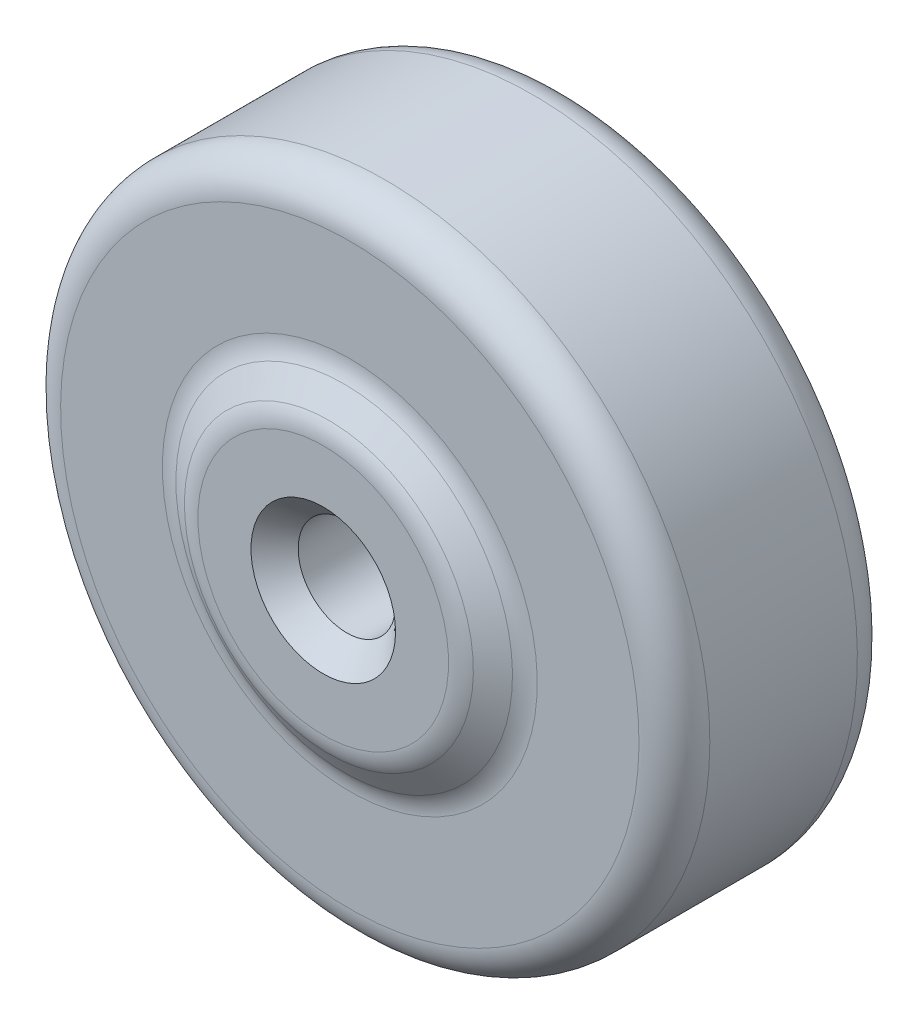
ISO-10303-21;
HEADER;
FILE_DESCRIPTION(('STEP AP214'),'2;1');
FILE_NAME('part.step','',(''),(''),'','','');
FILE_SCHEMA(('AUTOMOTIVE_DESIGN { 1 0 10303 214 1 1 1 1 }'));
ENDSEC;
DATA;
#1=APPLICATION_CONTEXT('core data for automotive mechanical design processes');
#2=APPLICATION_PROTOCOL_DEFINITION('international standard','automotive_design',2000,#1);
#3=PRODUCT_CONTEXT('',#1,'mechanical');
#4=PRODUCT('Part','Part','',(#3));
#5=PRODUCT_RELATED_PRODUCT_CATEGORY('part','',(#4));
#6=PRODUCT_DEFINITION_FORMATION('','',#4);
#7=PRODUCT_DEFINITION_CONTEXT('part definition',#1,'design');
#8=PRODUCT_DEFINITION('design','',#6,#7);
#9=PRODUCT_DEFINITION_SHAPE('','',#8);
#10=(LENGTH_UNIT() NAMED_UNIT(*) SI_UNIT(.MILLI.,.METRE.));
#11=(NAMED_UNIT(*) PLANE_ANGLE_UNIT() SI_UNIT($,.RADIAN.));
#12=(NAMED_UNIT(*) SI_UNIT($,.STERADIAN.) SOLID_ANGLE_UNIT());
#13=UNCERTAINTY_MEASURE_WITH_UNIT(LENGTH_MEASURE(1.E-05),#10,'distance_accuracy_value','');
#14=(GEOMETRIC_REPRESENTATION_CONTEXT(3) GLOBAL_UNCERTAINTY_ASSIGNED_CONTEXT((#13)) GLOBAL_UNIT_ASSIGNED_CONTEXT((#10,
#11,#12)) REPRESENTATION_CONTEXT('',''));
#15=CARTESIAN_POINT('',(0.,0.,0.));
#16=DIRECTION('',(0.,0.,1.));
#17=DIRECTION('',(1.,0.,0.));
#18=AXIS2_PLACEMENT_3D('',#15,#16,#17);
#19=CARTESIAN_POINT('',(4.125,0.,11.5));
#20=DIRECTION('',(0.,0.,1.));
#21=DIRECTION('',(1.,0.,0.));
#22=AXIS2_PLACEMENT_3D('',#19,#20,#21);
#23=PLANE('',#22);
#24=CARTESIAN_POINT('',(0.,0.,11.4999999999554));
#25=DIRECTION('',(0.,0.,1.));
#26=DIRECTION('',(1.,0.,0.));
#27=AXIS2_PLACEMENT_3D('',#24,#25,#26);
#28=CIRCLE('',#27,6.12500000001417);
#29=CARTESIAN_POINT('',(6.12500000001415,0.,11.4999999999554));
#30=VERTEX_POINT('',#29);
#31=EDGE_CURVE('E75',#30,#30,#28,.F.);
#32=ORIENTED_EDGE('',*,*,#31,.T.);
#33=EDGE_LOOP('',(#32));
#34=FACE_BOUND('',#33,.T.);
#35=CARTESIAN_POINT('',(0.,0.,11.5));
#36=DIRECTION('',(0.,0.,-1.));
#37=DIRECTION('',(0.877582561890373,0.479425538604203,0.));
#38=AXIS2_PLACEMENT_3D('',#35,#36,#37);
#39=CIRCLE('',#38,10.6188943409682);
#40=CARTESIAN_POINT('',(9.31895650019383,5.09096913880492,11.5));
#41=VERTEX_POINT('',#40);
#42=CARTESIAN_POINT('',(-9.31895657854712,-5.09096899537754,11.5));
#43=VERTEX_POINT('',#42);
#44=EDGE_CURVE('E65',#41,#43,#39,.T.);
#45=ORIENTED_EDGE('',*,*,#44,.F.);
#46=CARTESIAN_POINT('',(0.,0.,11.5));
#47=DIRECTION('',(0.,0.,-1.));
#48=DIRECTION('',(-0.877582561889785,-0.479425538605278,0.));
#49=AXIS2_PLACEMENT_3D('',#46,#47,#48);
#50=CIRCLE('',#49,10.6188943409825);
#51=EDGE_CURVE('E69',#43,#41,#50,.T.);
#52=ORIENTED_EDGE('',*,*,#51,.F.);
#53=EDGE_LOOP('',(#45,#52));
#54=FACE_BOUND('',#53,.T.);
#55=ADVANCED_FACE('F16',(#34,#54),#23,.T.);
#56=CARTESIAN_POINT('',(0.,0.,8.5));
#57=DIRECTION('',(0.,0.,1.));
#58=DIRECTION('',(0.877582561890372,0.479425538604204,0.));
#59=AXIS2_PLACEMENT_3D('',#56,#57,#58);
#60=TOROIDAL_SURFACE('',#59,10.618894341,3.);
#61=CARTESIAN_POINT('',(0.,0.,11.0235354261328));
#62=DIRECTION('',(0.,0.,-1.));
#63=DIRECTION('',(0.877582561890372,0.479425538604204,0.));
#64=AXIS2_PLACEMENT_3D('',#61,#62,#63);
#65=CIRCLE('',#64,12.2411671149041);
#66=CARTESIAN_POINT('',(10.7426347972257,5.86872813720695,11.0235354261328));
#67=VERTEX_POINT('',#66);
#68=EDGE_CURVE('E102',#67,#67,#65,.T.);
#69=ORIENTED_EDGE('',*,*,#68,.F.);
#70=EDGE_LOOP('',(#69));
#71=FACE_BOUND('',#70,.T.);
#72=ORIENTED_EDGE('',*,*,#51,.T.);
#73=ORIENTED_EDGE('',*,*,#44,.T.);
#74=EDGE_LOOP('',(#72,#73));
#75=FACE_BOUND('',#74,.T.);
#76=ADVANCED_FACE('F74',(#71,#75),#60,.T.);
#77=CARTESIAN_POINT('',(0.,0.,11.4999999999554));
#78=DIRECTION('',(0.,0.,1.));
#79=DIRECTION('',(1.,0.,0.));
#80=AXIS2_PLACEMENT_3D('',#77,#78,#79);
#81=CONICAL_SURFACE('',#80,6.12500000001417,0.785398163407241);
#82=ORIENTED_EDGE('',*,*,#31,.F.);
#83=EDGE_LOOP('',(#82));
#84=FACE_BOUND('',#83,.T.);
#85=CARTESIAN_POINT('',(0.,0.,9.5));
#86=DIRECTION('',(0.,0.,1.));
#87=DIRECTION('',(1.,0.,0.));
#88=AXIS2_PLACEMENT_3D('',#85,#86,#87);
#89=CIRCLE('',#88,4.125);
#90=CARTESIAN_POINT('',(4.125,0.,9.5));
#91=VERTEX_POINT('',#90);
#92=EDGE_CURVE('E100',#91,#91,#89,.F.);
#93=ORIENTED_EDGE('',*,*,#92,.T.);
#94=EDGE_LOOP('',(#93));
#95=FACE_BOUND('',#94,.T.);
#96=ADVANCED_FACE('F94',(#84,#95),#81,.F.);
#97=CARTESIAN_POINT('',(0.,0.,9.72646457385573));
#98=DIRECTION('',(0.,0.,-1.));
#99=DIRECTION('',(-1.,0.,0.));
#100=AXIS2_PLACEMENT_3D('',#97,#98,#99);
#101=CONICAL_SURFACE('',#100,14.2588328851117,0.999458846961);
#102=CARTESIAN_POINT('',(0.,0.,9.72646457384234));
#103=DIRECTION('',(0.,0.,1.));
#104=DIRECTION('',(0.877582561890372,0.479425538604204,0.));
#105=AXIS2_PLACEMENT_3D('',#102,#103,#104);
#106=CIRCLE('',#105,14.2588328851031);
#107=CARTESIAN_POINT('',(12.5133030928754,6.83604863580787,9.72646457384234));
#108=VERTEX_POINT('',#107);
#109=EDGE_CURVE('E107',#108,#108,#106,.T.);
#110=ORIENTED_EDGE('',*,*,#109,.T.);
#111=EDGE_LOOP('',(#110));
#112=FACE_BOUND('',#111,.T.);
#113=ORIENTED_EDGE('',*,*,#68,.T.);
#114=EDGE_LOOP('',(#113));
#115=FACE_BOUND('',#114,.T.);
#116=ADVANCED_FACE('F296',(#112,#115),#101,.T.);
#117=CARTESIAN_POINT('',(0.,0.,12.25));
#118=DIRECTION('',(0.,0.,1.));
#119=DIRECTION('',(0.877582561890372,0.479425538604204,0.));
#120=AXIS2_PLACEMENT_3D('',#117,#118,#119);
#121=TOROIDAL_SURFACE('',#120,15.881105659,3.);
#122=CARTESIAN_POINT('',(0.,0.,9.25));
#123=DIRECTION('',(0.,0.,1.));
#124=DIRECTION('',(0.877582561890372,0.479425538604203,0.));
#125=AXIS2_PLACEMENT_3D('',#122,#123,#124);
#126=CIRCLE('',#125,15.8811056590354);
#127=CARTESIAN_POINT('',(-13.9369813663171,-7.61380767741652,9.25));
#128=VERTEX_POINT('',#127);
#129=CARTESIAN_POINT('',(13.9369813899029,7.61380763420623,9.25));
#130=VERTEX_POINT('',#129);
#131=EDGE_CURVE('E269',#128,#130,#126,.F.);
#132=ORIENTED_EDGE('',*,*,#131,.F.);
#133=CARTESIAN_POINT('',(-13.9369813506,-7.61380770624,9.25));
#134=CARTESIAN_POINT('',(-13.8124054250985,-7.84185390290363,9.25));
#135=CARTESIAN_POINT('',(-13.6822231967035,-8.066836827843,9.25));
#136=CARTESIAN_POINT('',(-13.4109804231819,-8.51014677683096,9.25));
#137=CARTESIAN_POINT('',(-13.2699198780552,-8.72847380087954,9.25));
#138=CARTESIAN_POINT('',(-12.9772547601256,-9.15794259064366,9.25));
#139=CARTESIAN_POINT('',(-12.8256501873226,-9.3690843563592,9.25));
#140=CARTESIAN_POINT('',(-12.5122637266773,-9.78367487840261,9.25));
#141=CARTESIAN_POINT('',(-12.3504818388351,-9.9871236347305,9.25));
#142=CARTESIAN_POINT('',(-12.0171300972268,-10.3858377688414,9.25));
#143=CARTESIAN_POINT('',(-11.8455602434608,-10.5811031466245,9.25));
#144=CARTESIAN_POINT('',(-11.4930460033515,-10.962980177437,9.25));
#145=CARTESIAN_POINT('',(-11.3121016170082,-11.1495918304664,9.25));
#146=CARTESIAN_POINT('',(-10.9412741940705,-11.5137118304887,9.25));
#147=CARTESIAN_POINT('',(-10.751391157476,-11.6912201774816,9.25));
#148=CARTESIAN_POINT('',(-10.3631438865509,-12.0367059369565,9.25));
#149=CARTESIAN_POINT('',(-10.1647796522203,-12.2046833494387,9.25));
#150=CARTESIAN_POINT('',(-9.76004786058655,-12.5307025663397,9.25));
#151=CARTESIAN_POINT('',(-9.55368030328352,-12.6887443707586,9.25));
#152=CARTESIAN_POINT('',(-9.13343902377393,-12.9945116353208,9.25));
#153=CARTESIAN_POINT('',(-8.91956530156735,-13.1422370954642,9.25));
#154=CARTESIAN_POINT('',(-8.4848269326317,-13.4270157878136,9.25));
#155=CARTESIAN_POINT('',(-8.26396228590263,-13.5640690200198,9.25));
#156=CARTESIAN_POINT('',(-7.81577415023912,-13.8271730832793,9.25));
#157=CARTESIAN_POINT('',(-7.58845066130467,-13.9532239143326,9.25));
#158=CARTESIAN_POINT('',(-7.12789248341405,-14.1940195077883,9.25));
#159=CARTESIAN_POINT('',(-6.89465779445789,-14.3087642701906,9.25));
#160=CARTESIAN_POINT('',(-6.42283909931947,-14.5266712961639,9.25));
#161=CARTESIAN_POINT('',(-6.18425509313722,-14.6298335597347,9.25));
#162=CARTESIAN_POINT('',(-5.70231253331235,-14.8243270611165,9.25));
#163=CARTESIAN_POINT('',(-5.45895397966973,-14.9156582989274,9.25));
#164=CARTESIAN_POINT('',(-4.96804859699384,-15.0862697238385,9.25));
#165=CARTESIAN_POINT('',(-4.72050176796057,-15.1655499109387,9.25));
#166=CARTESIAN_POINT('',(-4.22181619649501,-15.3118682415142,9.25));
#167=CARTESIAN_POINT('',(-3.97067745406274,-15.3789063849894,9.25));
#168=CARTESIAN_POINT('',(-3.4654130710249,-15.500579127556,9.25));
#169=CARTESIAN_POINT('',(-3.21128743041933,-15.5552137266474,9.25));
#170=CARTESIAN_POINT('',(-2.70066146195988,-15.651947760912,9.25));
#171=CARTESIAN_POINT('',(-2.44416113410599,-15.6940471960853,9.25));
#172=CARTESIAN_POINT('',(-1.92940372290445,-15.7656094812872,9.25));
#173=CARTESIAN_POINT('',(-1.67114663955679,-15.795072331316,9.25));
#174=CARTESIAN_POINT('',(-1.15349788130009,-15.8412904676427,9.25));
#175=CARTESIAN_POINT('',(-0.894106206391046,-15.8580457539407,9.25));
#176=CARTESIAN_POINT('',(-0.374813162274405,-15.8788083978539,9.25));
#177=CARTESIAN_POINT('',(-0.114911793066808,-15.882815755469,9.25));
#178=CARTESIAN_POINT('',(0.404774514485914,-15.8780728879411,9.25));
#179=CARTESIAN_POINT('',(0.664559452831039,-15.8693226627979,9.25));
#180=CARTESIAN_POINT('',(1.18338705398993,-15.8390857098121,9.25));
#181=CARTESIAN_POINT('',(1.44242971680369,-15.8175989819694,9.25));
#182=CARTESIAN_POINT('',(1.95914871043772,-15.7619407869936,9.25));
#183=CARTESIAN_POINT('',(2.21682504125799,-15.7277693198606,9.25));
#184=CARTESIAN_POINT('',(2.73019060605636,-15.6468239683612,9.25));
#185=CARTESIAN_POINT('',(2.98587984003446,-15.6000500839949,9.25));
#186=CARTESIAN_POINT('',(3.49465523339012,-15.4940125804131,9.25));
#187=CARTESIAN_POINT('',(3.74774139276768,-15.4347489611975,9.25));
#188=CARTESIAN_POINT('',(4.25070093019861,-15.3038747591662,9.25));
#189=CARTESIAN_POINT('',(4.50057430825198,-15.2322641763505,9.25));
#190=CARTESIAN_POINT('',(4.99650631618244,-15.0768685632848,9.25));
#191=CARTESIAN_POINT('',(5.24256494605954,-14.9930835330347,9.25));
#192=CARTESIAN_POINT('',(5.73027468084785,-14.8135408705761,9.25));
#193=CARTESIAN_POINT('',(5.97192578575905,-14.7177832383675,9.25));
#194=CARTESIAN_POINT('',(6.45023831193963,-14.5145260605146,9.25));
#195=CARTESIAN_POINT('',(6.68689973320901,-14.4070265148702,9.25));
#196=CARTESIAN_POINT('',(7.15466275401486,-14.1805444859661,9.25));
#197=CARTESIAN_POINT('',(7.38576435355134,-14.0615620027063,9.25));
#198=CARTESIAN_POINT('',(7.84185098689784,-13.8124007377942,9.25));
#199=CARTESIAN_POINT('',(8.06683602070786,-13.6822219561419,9.25));
#200=CARTESIAN_POINT('',(8.51014751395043,-13.410981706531,9.25));
#201=CARTESIAN_POINT('',(8.72847397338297,-13.2699202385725,9.25));
#202=CARTESIAN_POINT('',(9.15794235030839,-12.9772544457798,9.25));
#203=CARTESIAN_POINT('',(9.36908426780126,-12.8256501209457,9.25));
#204=CARTESIAN_POINT('',(9.78367490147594,-12.5122638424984,9.25));
#205=CARTESIAN_POINT('',(9.98712361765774,-12.3504818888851,9.25));
#206=CARTESIAN_POINT('',(10.3858377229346,-12.0171300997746,9.25));
#207=CARTESIAN_POINT('',(10.5811031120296,-11.8455602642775,9.25));
#208=CARTESIAN_POINT('',(10.962980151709,-11.4930460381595,9.25));
#209=CARTESIAN_POINT('',(11.1495918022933,-11.3121016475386,9.25));
#210=CARTESIAN_POINT('',(11.513711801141,-10.9412742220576,9.25));
#211=CARTESIAN_POINT('',(11.6912201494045,-10.7513911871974,9.25));
#212=CARTESIAN_POINT('',(12.0367059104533,-10.3631439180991,9.25));
#213=CARTESIAN_POINT('',(12.2046833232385,-10.1647796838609,9.25));
#214=CARTESIAN_POINT('',(12.5307025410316,-9.76004789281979,9.25));
#215=CARTESIAN_POINT('',(12.6887443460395,-9.55368033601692,9.25));
#216=CARTESIAN_POINT('',(12.994511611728,-9.13343905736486,9.25));
#217=CARTESIAN_POINT('',(13.1422370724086,-8.91956533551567,9.25));
#218=CARTESIAN_POINT('',(13.4270157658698,-8.48482696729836,9.25));
#219=CARTESIAN_POINT('',(13.5640689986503,-8.26396232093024,9.25));
#220=CARTESIAN_POINT('',(13.8271730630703,-7.81577418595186,9.25));
#221=CARTESIAN_POINT('',(13.9532238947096,-7.58845069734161,9.25));
#222=CARTESIAN_POINT('',(14.194019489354,-7.12789252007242,9.25));
#223=CARTESIAN_POINT('',(14.308764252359,-6.89465783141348,9.25));
#224=CARTESIAN_POINT('',(14.526671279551,-6.42283913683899,9.25));
#225=CARTESIAN_POINT('',(14.6298335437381,-6.18425513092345,9.25));
#226=CARTESIAN_POINT('',(14.8243270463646,-5.70231257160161,9.25));
#227=CARTESIAN_POINT('',(14.9156582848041,-5.45895401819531,9.25));
#228=CARTESIAN_POINT('',(15.0862697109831,-4.96804863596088,9.25));
#229=CARTESIAN_POINT('',(15.1655498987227,-4.72050180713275,9.25));
#230=CARTESIAN_POINT('',(15.3118682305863,-4.2218162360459,9.25));
#231=CARTESIAN_POINT('',(15.3789063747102,-3.97067749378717,9.25));
#232=CARTESIAN_POINT('',(15.500579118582,-3.46541311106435,9.25));
#233=CARTESIAN_POINT('',(15.5552137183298,-3.21128747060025,9.25));
#234=CARTESIAN_POINT('',(15.6519477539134,-2.70066150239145,9.25));
#235=CARTESIAN_POINT('',(15.6940471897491,-2.44416117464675,9.25));
#236=CARTESIAN_POINT('',(15.7656094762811,-1.92940376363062,9.25));
#237=CARTESIAN_POINT('',(15.7950723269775,-1.67114668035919,9.25));
#238=CARTESIAN_POINT('',(15.8412904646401,-1.15349792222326,9.25));
#239=CARTESIAN_POINT('',(15.8580457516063,-0.894106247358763,9.25));
#240=CARTESIAN_POINT('',(15.8788083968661,-0.374813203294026,9.25));
#241=CARTESIAN_POINT('',(15.8828157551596,-0.114911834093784,9.25));
#242=CARTESIAN_POINT('',(15.8780728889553,0.404774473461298,9.25));
#243=CARTESIAN_POINT('',(15.8693226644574,0.664559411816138,9.25));
#244=CARTESIAN_POINT('',(15.8390857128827,1.18338701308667,9.25));
#245=CARTESIAN_POINT('',(15.8175989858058,1.44242967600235,9.25));
#246=CARTESIAN_POINT('',(15.7619407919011,1.95914866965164,9.25));
#247=CARTESIAN_POINT('',(15.7277693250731,2.21682500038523,9.25));
#248=CARTESIAN_POINT('',(15.6468239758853,2.730190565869,9.25));
#249=CARTESIAN_POINT('',(15.6000500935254,2.98587980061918,9.25));
#250=CARTESIAN_POINT('',(15.4940125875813,3.4946551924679,9.25));
#251=CARTESIAN_POINT('',(15.4347489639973,3.74774134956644,9.25));
#252=CARTESIAN_POINT('',(15.3038747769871,4.25070089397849,9.25));
#253=CARTESIAN_POINT('',(15.232264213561,4.500574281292,9.25));
#254=CARTESIAN_POINT('',(15.0768685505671,4.99650626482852,9.25));
#255=CARTESIAN_POINT('',(14.9930834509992,5.24256486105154,9.25));
#256=CARTESIAN_POINT('',(14.8135409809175,5.7302746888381,9.25));
#257=CARTESIAN_POINT('',(14.7177836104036,5.97192592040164,9.25));
#258=CARTESIAN_POINT('',(14.5145257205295,6.45023810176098,9.25));
#259=CARTESIAN_POINT('',(14.4070252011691,6.68689905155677,9.25));
#260=CARTESIAN_POINT('',(14.1805458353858,7.15466336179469,9.25));
#261=CARTESIAN_POINT('',(14.0615669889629,7.38576672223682,9.25));
#262=CARTESIAN_POINT('',(13.9369813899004,7.61380763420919,9.25));
#263=B_SPLINE_CURVE_WITH_KNOTS('',3,(#133,#134,#135,#136,#137,#138,#139,#140,#141,#142,#143,
#144,#145,#146,#147,#148,#149,#150,#151,#152,#153,#154,#155,#156,#157,#158,#159,#160,#161,#162,
#163,#164,#165,#166,#167,#168,#169,#170,#171,#172,#173,#174,#175,#176,#177,#178,#179,#180,#181,
#182,#183,#184,#185,#186,#187,#188,#189,#190,#191,#192,#193,#194,#195,#196,#197,#198,#199,#200,
#201,#202,#203,#204,#205,#206,#207,#208,#209,#210,#211,#212,#213,#214,#215,#216,#217,#218,#219,
#220,#221,#222,#223,#224,#225,#226,#227,#228,#229,#230,#231,#232,#233,#234,#235,#236,#237,#238,
#239,#240,#241,#242,#243,#244,#245,#246,#247,#248,#249,#250,#251,#252,#253,#254,#255,#256,#257,
#258,#259,#260,#261,#262),.UNSPECIFIED.,.F.,.F.,(4,2,2,2,2,2,2,2,2,2,2,2,2,2,2,2,2,2,2,2,2,2,2,
2,2,2,2,2,2,2,2,2,2,2,2,2,2,2,2,2,2,2,2,2,2,2,2,2,2,2,2,2,2,2,2,2,2,2,2,2,2,2,2,2,4),(0.,
0.779483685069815,1.5589673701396,2.33845105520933,3.11793474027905,3.89741842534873,
4.67690211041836,5.45638579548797,6.23586948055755,7.0153531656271,7.79483685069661,
8.57432053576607,9.35380422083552,10.1332879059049,10.9127715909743,11.6922552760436,
12.4717389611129,13.2512226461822,14.0307063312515,14.8101900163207,15.5896737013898,
16.369157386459,17.1486410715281,17.9281247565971,18.7076084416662,19.4870921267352,
20.2665758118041,21.0460594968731,21.825543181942,22.6050268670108,23.3845105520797,
24.1639942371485,24.9434779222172,25.722961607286,26.5024452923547,27.2819289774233,
28.061412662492,28.8408963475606,29.6203800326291,30.3998637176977,31.1793474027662,
31.9588310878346,32.738314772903,33.5177984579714,34.2972821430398,35.0767658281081,
35.8562495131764,36.6357331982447,37.4152168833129,38.1947005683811,38.9741842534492,
39.7536679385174,40.5331516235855,41.3126353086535,42.0921189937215,42.8716026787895,
43.6510863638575,44.4305700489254,45.2100537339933,45.9895374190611,46.769021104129,
47.5485047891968,48.3279884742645,49.1074721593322,49.8869558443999),.UNSPECIFIED.);
#264=EDGE_CURVE('E314',#130,#128,#263,.F.);
#265=ORIENTED_EDGE('',*,*,#264,.F.);
#266=EDGE_LOOP('',(#132,#265));
#267=FACE_BOUND('',#266,.T.);
#268=ORIENTED_EDGE('',*,*,#109,.F.);
#269=EDGE_LOOP('',(#268));
#270=FACE_BOUND('',#269,.T.);
#271=ADVANCED_FACE('F293',(#267,#270),#121,.F.);
#272=CARTESIAN_POINT('',(0.,0.,0.));
#273=DIRECTION('',(0.,0.,1.));
#274=DIRECTION('',(1.,0.,0.));
#275=AXIS2_PLACEMENT_3D('',#272,#273,#274);
#276=CYLINDRICAL_SURFACE('',#275,4.125);
#277=ORIENTED_EDGE('',*,*,#92,.F.);
#278=EDGE_LOOP('',(#277));
#279=FACE_BOUND('',#278,.T.);
#280=CARTESIAN_POINT('',(0.,0.,-9.49999999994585));
#281=DIRECTION('',(0.,0.,-1.));
#282=DIRECTION('',(0.877582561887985,0.479425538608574,0.));
#283=AXIS2_PLACEMENT_3D('',#280,#281,#282);
#284=CIRCLE('',#283,4.12499999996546);
#285=CARTESIAN_POINT('',(3.62002806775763,1.97763034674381,-9.49999999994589));
#286=VERTEX_POINT('',#285);
#287=EDGE_CURVE('E282',#286,#286,#284,.T.);
#288=ORIENTED_EDGE('',*,*,#287,.T.);
#289=EDGE_LOOP('',(#288));
#290=FACE_BOUND('',#289,.T.);
#291=ADVANCED_FACE('F249',(#279,#290),#276,.F.);
#292=CARTESIAN_POINT('',(15.,0.,9.25));
#293=DIRECTION('',(0.,0.,1.));
#294=DIRECTION('',(1.,0.,0.));
#295=AXIS2_PLACEMENT_3D('',#292,#293,#294);
#296=PLANE('',#295);
#297=ORIENTED_EDGE('',*,*,#264,.T.);
#298=ORIENTED_EDGE('',*,*,#131,.T.);
#299=EDGE_LOOP('',(#297,#298));
#300=FACE_BOUND('',#299,.T.);
#301=CARTESIAN_POINT('',(0.,0.,9.25));
#302=DIRECTION('',(0.,0.,-1.));
#303=DIRECTION('',(0.877582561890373,0.479425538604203,0.));
#304=AXIS2_PLACEMENT_3D('',#301,#302,#303);
#305=CIRCLE('',#304,24.4999999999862);
#306=CARTESIAN_POINT('',(21.5007727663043,11.7459256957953,9.25));
#307=VERTEX_POINT('',#306);
#308=CARTESIAN_POINT('',(-21.5007727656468,-11.7459256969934,9.25));
#309=VERTEX_POINT('',#308);
#310=EDGE_CURVE('E207',#307,#309,#305,.T.);
#311=ORIENTED_EDGE('',*,*,#310,.F.);
#312=CARTESIAN_POINT('',(0.,0.,9.25));
#313=DIRECTION('',(0.,0.,-1.));
#314=DIRECTION('',(-0.877582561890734,-0.479425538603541,0.));
#315=AXIS2_PLACEMENT_3D('',#312,#313,#314);
#316=CIRCLE('',#315,24.4999999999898);
#317=EDGE_CURVE('E278',#309,#307,#316,.T.);
#318=ORIENTED_EDGE('',*,*,#317,.F.);
#319=EDGE_LOOP('',(#311,#318));
#320=FACE_BOUND('',#319,.T.);
#321=ADVANCED_FACE('F240',(#300,#320),#296,.T.);
#322=CARTESIAN_POINT('',(0.,0.,-11.4999999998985));
#323=DIRECTION('',(0.,0.,-1.));
#324=DIRECTION('',(-1.,0.,0.));
#325=AXIS2_PLACEMENT_3D('',#322,#323,#324);
#326=CONICAL_SURFACE('',#325,6.12499999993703,0.785398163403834);
#327=ORIENTED_EDGE('',*,*,#287,.F.);
#328=EDGE_LOOP('',(#327));
#329=FACE_BOUND('',#328,.T.);
#330=CARTESIAN_POINT('',(0.,0.,-11.4999999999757));
#331=DIRECTION('',(0.,0.,-1.));
#332=DIRECTION('',(-1.,0.,0.));
#333=AXIS2_PLACEMENT_3D('',#330,#331,#332);
#334=CIRCLE('',#333,6.12500000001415);
#335=CARTESIAN_POINT('',(-6.12500000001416,0.,-11.4999999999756));
#336=VERTEX_POINT('',#335);
#337=EDGE_CURVE('E83',#336,#336,#334,.T.);
#338=ORIENTED_EDGE('',*,*,#337,.T.);
#339=EDGE_LOOP('',(#338));
#340=FACE_BOUND('',#339,.T.);
#341=ADVANCED_FACE('F223',(#329,#340),#326,.F.);
#342=CARTESIAN_POINT('',(0.,0.,6.25));
#343=DIRECTION('',(0.,0.,1.));
#344=DIRECTION('',(0.877582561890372,0.479425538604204,0.));
#345=AXIS2_PLACEMENT_3D('',#342,#343,#344);
#346=TOROIDAL_SURFACE('',#345,24.5,3.);
#347=CARTESIAN_POINT('',(0.,0.,6.25));
#348=DIRECTION('',(0.,0.,1.));
#349=DIRECTION('',(1.,0.,0.));
#350=AXIS2_PLACEMENT_3D('',#347,#348,#349);
#351=CIRCLE('',#350,27.5);
#352=CARTESIAN_POINT('',(27.5,0.,6.25));
#353=VERTEX_POINT('',#352);
#354=EDGE_CURVE('E230',#353,#353,#351,.F.);
#355=ORIENTED_EDGE('',*,*,#354,.F.);
#356=EDGE_LOOP('',(#355));
#357=FACE_BOUND('',#356,.T.);
#358=ORIENTED_EDGE('',*,*,#317,.T.);
#359=ORIENTED_EDGE('',*,*,#310,.T.);
#360=EDGE_LOOP('',(#358,#359));
#361=FACE_BOUND('',#360,.T.);
#362=ADVANCED_FACE('F214',(#357,#361),#346,.T.);
#363=CARTESIAN_POINT('',(4.125,0.,-11.5));
#364=DIRECTION('',(0.,0.,1.));
#365=DIRECTION('',(1.,0.,0.));
#366=AXIS2_PLACEMENT_3D('',#363,#364,#365);
#367=PLANE('',#366);
#368=ORIENTED_EDGE('',*,*,#337,.F.);
#369=EDGE_LOOP('',(#368));
#370=FACE_BOUND('',#369,.T.);
#371=CARTESIAN_POINT('',(0.,0.,-11.5));
#372=DIRECTION('',(0.,0.,1.));
#373=DIRECTION('',(-0.877582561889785,-0.479425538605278,0.));
#374=AXIS2_PLACEMENT_3D('',#371,#372,#373);
#375=CIRCLE('',#374,10.6188943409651);
#376=CARTESIAN_POINT('',(-9.31895657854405,-5.09096899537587,-11.5));
#377=VERTEX_POINT('',#376);
#378=CARTESIAN_POINT('',(9.31895650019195,5.09096913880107,-11.5));
#379=VERTEX_POINT('',#378);
#380=EDGE_CURVE('E374',#377,#379,#375,.T.);
#381=ORIENTED_EDGE('',*,*,#380,.F.);
#382=CARTESIAN_POINT('',(0.,0.,-11.5));
#383=DIRECTION('',(0.,0.,1.));
#384=DIRECTION('',(0.877582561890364,0.479425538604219,0.));
#385=AXIS2_PLACEMENT_3D('',#382,#383,#384);
#386=CIRCLE('',#385,10.6188943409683);
#387=EDGE_CURVE('E233',#379,#377,#386,.T.);
#388=ORIENTED_EDGE('',*,*,#387,.F.);
#389=EDGE_LOOP('',(#381,#388));
#390=FACE_BOUND('',#389,.T.);
#391=ADVANCED_FACE('F184',(#370,#390),#367,.F.);
#392=CARTESIAN_POINT('',(0.,0.,-8.5));
#393=DIRECTION('',(0.,0.,1.));
#394=DIRECTION('',(-0.975671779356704,-0.219236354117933,0.));
#395=AXIS2_PLACEMENT_3D('',#392,#393,#394);
#396=TOROIDAL_SURFACE('',#395,10.618894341,3.);
#397=ORIENTED_EDGE('',*,*,#387,.T.);
#398=ORIENTED_EDGE('',*,*,#380,.T.);
#399=EDGE_LOOP('',(#397,#398));
#400=FACE_BOUND('',#399,.T.);
#401=CARTESIAN_POINT('',(0.,0.,-11.0235354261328));
#402=DIRECTION('',(0.,0.,1.));
#403=DIRECTION('',(0.877582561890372,0.479425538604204,0.));
#404=AXIS2_PLACEMENT_3D('',#401,#402,#403);
#405=CIRCLE('',#404,12.2411671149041);
#406=CARTESIAN_POINT('',(10.7426347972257,5.86872813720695,-11.0235354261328));
#407=VERTEX_POINT('',#406);
#408=EDGE_CURVE('E173',#407,#407,#405,.T.);
#409=ORIENTED_EDGE('',*,*,#408,.F.);
#410=EDGE_LOOP('',(#409));
#411=FACE_BOUND('',#410,.T.);
#412=ADVANCED_FACE('F178',(#400,#411),#396,.T.);
#413=CARTESIAN_POINT('',(0.,0.,0.));
#414=DIRECTION('',(0.,0.,1.));
#415=DIRECTION('',(1.,0.,0.));
#416=AXIS2_PLACEMENT_3D('',#413,#414,#415);
#417=CYLINDRICAL_SURFACE('',#416,27.5);
#418=ORIENTED_EDGE('',*,*,#354,.T.);
#419=EDGE_LOOP('',(#418));
#420=FACE_BOUND('',#419,.T.);
#421=CARTESIAN_POINT('',(0.,0.,-6.25));
#422=DIRECTION('',(0.,0.,1.));
#423=DIRECTION('',(0.877582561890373,0.479425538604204,0.));
#424=AXIS2_PLACEMENT_3D('',#421,#422,#423);
#425=CIRCLE('',#424,27.5);
#426=CARTESIAN_POINT('',(24.1335204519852,13.1842023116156,-6.25));
#427=VERTEX_POINT('',#426);
#428=EDGE_CURVE('E170',#427,#427,#425,.F.);
#429=ORIENTED_EDGE('',*,*,#428,.F.);
#430=EDGE_LOOP('',(#429));
#431=FACE_BOUND('',#430,.T.);
#432=ADVANCED_FACE('F183',(#420,#431),#417,.T.);
#433=CARTESIAN_POINT('',(0.,0.,-9.72646457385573));
#434=DIRECTION('',(0.,0.,1.));
#435=DIRECTION('',(1.,0.,0.));
#436=AXIS2_PLACEMENT_3D('',#433,#434,#435);
#437=CONICAL_SURFACE('',#436,14.2588328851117,0.999458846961);
#438=CARTESIAN_POINT('',(0.,0.,-9.72646457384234));
#439=DIRECTION('',(0.,0.,1.));
#440=DIRECTION('',(-0.947436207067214,-0.319944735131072,0.));
#441=AXIS2_PLACEMENT_3D('',#438,#439,#440);
#442=CIRCLE('',#441,14.2588328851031);
#443=CARTESIAN_POINT('',(-13.5093345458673,-4.56203851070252,-9.72646457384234));
#444=VERTEX_POINT('',#443);
#445=EDGE_CURVE('E161',#444,#444,#442,.F.);
#446=ORIENTED_EDGE('',*,*,#445,.T.);
#447=EDGE_LOOP('',(#446));
#448=FACE_BOUND('',#447,.T.);
#449=ORIENTED_EDGE('',*,*,#408,.T.);
#450=EDGE_LOOP('',(#449));
#451=FACE_BOUND('',#450,.T.);
#452=ADVANCED_FACE('F357',(#448,#451),#437,.T.);
#453=CARTESIAN_POINT('',(0.,0.,-6.25));
#454=DIRECTION('',(0.,0.,1.));
#455=DIRECTION('',(0.877582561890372,0.479425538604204,0.));
#456=AXIS2_PLACEMENT_3D('',#453,#454,#455);
#457=TOROIDAL_SURFACE('',#456,24.5,3.);
#458=CARTESIAN_POINT('',(-21.5007727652,-11.7459256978,-9.25));
#459=CARTESIAN_POINT('',(-21.3085877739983,-12.0977357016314,-9.25));
#460=CARTESIAN_POINT('',(-21.1077538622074,-12.4448199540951,-9.25));
#461=CARTESIAN_POINT('',(-20.689303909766,-13.1287203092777,-9.25));
#462=CARTESIAN_POINT('',(-20.4716878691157,-13.4655364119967,-9.25));
#463=CARTESIAN_POINT('',(-20.0201893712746,-14.1280838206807,-9.25));
#464=CARTESIAN_POINT('',(-19.7863069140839,-14.4538151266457,-9.25));
#465=CARTESIAN_POINT('',(-19.3028413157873,-15.0934096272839,-9.25));
#466=CARTESIAN_POINT('',(-19.0532581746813,-15.4072728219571,-9.25));
#467=CARTESIAN_POINT('',(-18.5389918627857,-16.0223746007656,-9.25));
#468=CARTESIAN_POINT('',(-18.2743086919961,-16.3236131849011,-9.25));
#469=CARTESIAN_POINT('',(-17.7304801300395,-16.9127401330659,-9.25));
#470=CARTESIAN_POINT('',(-17.4513347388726,-17.2006284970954,-9.25));
#471=CARTESIAN_POINT('',(-16.8792541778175,-17.7623614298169,-9.25));
#472=CARTESIAN_POINT('',(-16.5863190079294,-18.0362059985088,-9.25));
#473=CARTESIAN_POINT('',(-15.9873646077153,-18.5691916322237,-9.25));
#474=CARTESIAN_POINT('',(-15.6813453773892,-18.8283326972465,-9.25));
#475=CARTESIAN_POINT('',(-15.056960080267,-19.3312870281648,-9.25));
#476=CARTESIAN_POINT('',(-14.7385940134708,-19.5751002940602,-9.25));
#477=CARTESIAN_POINT('',(-14.0902820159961,-20.046811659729,-9.25));
#478=CARTESIAN_POINT('',(-13.7603360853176,-20.2747097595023,-9.25));
#479=CARTESIAN_POINT('',(-13.0896592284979,-20.7140417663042,-9.25));
#480=CARTESIAN_POINT('',(-12.7489283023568,-20.9254756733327,-9.25));
#481=CARTESIAN_POINT('',(-12.0575023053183,-21.3313699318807,-9.25));
#482=CARTESIAN_POINT('',(-11.7068072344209,-21.5258302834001,-9.25));
#483=CARTESIAN_POINT('',(-10.9962978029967,-21.8973089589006,-9.25));
#484=CARTESIAN_POINT('',(-10.6364834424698,-22.0743272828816,-9.25));
#485=CARTESIAN_POINT('',(-9.90860225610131,-22.4104954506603,-9.25));
#486=CARTESIAN_POINT('',(-9.54053543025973,-22.569645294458,-9.25));
#487=CARTESIAN_POINT('',(-8.79703601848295,-22.869693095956,-9.25));
#488=CARTESIAN_POINT('',(-8.42160343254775,-23.0105910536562,-9.25));
#489=CARTESIAN_POINT('',(-7.66427695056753,-23.273795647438,-9.25));
#490=CARTESIAN_POINT('',(-7.2823830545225,-23.3961022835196,-9.25));
#491=CARTESIAN_POINT('',(-6.51305396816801,-23.621829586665,-9.25));
#492=CARTESIAN_POINT('',(-6.12561877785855,-23.7252502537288,-9.25));
#493=CARTESIAN_POINT('',(-5.34614046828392,-23.9129564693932,-9.25));
#494=CARTESIAN_POINT('',(-4.95409734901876,-23.9972420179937,-9.25));
#495=CARTESIAN_POINT('',(-4.1663476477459,-24.1464749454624,-9.25));
#496=CARTESIAN_POINT('',(-3.77064106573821,-24.2114223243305,-9.25));
#497=CARTESIAN_POINT('',(-2.97651773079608,-24.32182244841,-9.25));
#498=CARTESIAN_POINT('',(-2.57810097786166,-24.3672751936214,-9.25));
#499=CARTESIAN_POINT('',(-1.77951712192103,-24.4385765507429,-9.25));
#500=CARTESIAN_POINT('',(-1.37935001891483,-24.464425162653,-9.25));
#501=CARTESIAN_POINT('',(-0.578229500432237,-24.496455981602,-9.25));
#502=CARTESIAN_POINT('',(-0.177276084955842,-24.5026381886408,-9.25));
#503=CARTESIAN_POINT('',(0.624451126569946,-24.4953213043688,-9.25));
#504=CARTESIAN_POINT('',(1.02522492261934,-24.481822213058,-9.25));
#505=CARTESIAN_POINT('',(1.82562739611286,-24.4351752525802,-9.25));
#506=CARTESIAN_POINT('',(2.22525607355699,-24.4020273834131,-9.25));
#507=CARTESIAN_POINT('',(3.02240556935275,-24.316162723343,-9.25));
#508=CARTESIAN_POINT('',(3.41992638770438,-24.2634459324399,-9.25));
#509=CARTESIAN_POINT('',(4.21190250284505,-24.1385704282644,-9.25));
#510=CARTESIAN_POINT('',(4.6063577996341,-24.066411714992,-9.25));
#511=CARTESIAN_POINT('',(5.39125259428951,-23.9028262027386,-9.25));
#512=CARTESIAN_POINT('',(5.78169209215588,-23.8113994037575,-9.25));
#513=CARTESIAN_POINT('',(6.55761468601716,-23.6094979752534,-9.25));
#514=CARTESIAN_POINT('',(6.94309778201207,-23.4990233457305,-9.25));
#515=CARTESIAN_POINT('',(7.70817890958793,-23.2592923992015,-9.25));
#516=CARTESIAN_POINT('',(8.08777694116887,-23.1300360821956,-9.25));
#517=CARTESIAN_POINT('',(8.84017345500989,-22.8530531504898,-9.25));
#518=CARTESIAN_POINT('',(9.21297193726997,-22.7053265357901,-9.25));
#519=CARTESIAN_POINT('',(9.95087124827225,-22.3917588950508,-9.25));
#520=CARTESIAN_POINT('',(10.3159720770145,-22.2259178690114,-9.25));
#521=CARTESIAN_POINT('',(11.0375965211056,-21.8765209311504,-9.25));
#522=CARTESIAN_POINT('',(11.3941201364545,-21.6929650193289,-9.25));
#523=CARTESIAN_POINT('',(12.0977312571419,-21.3085805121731,-9.25));
#524=CARTESIAN_POINT('',(12.4448187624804,-21.1077519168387,-9.25));
#525=CARTESIAN_POINT('',(13.1287214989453,-20.6893058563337,-9.25));
#526=CARTESIAN_POINT('',(13.4655367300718,-20.4716883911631,-9.25));
#527=CARTESIAN_POINT('',(14.1280835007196,-20.0201888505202,-9.25));
#528=CARTESIAN_POINT('',(14.4538150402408,-19.786306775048,-9.25));
#529=CARTESIAN_POINT('',(15.0934097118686,-19.3028414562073,-9.25));
#530=CARTESIAN_POINT('',(15.4072728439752,-19.0532582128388,-9.25));
#531=CARTESIAN_POINT('',(16.0223745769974,-18.5389918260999,-9.25));
#532=CARTESIAN_POINT('',(16.323613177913,-18.2743086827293,-9.25));
#533=CARTESIAN_POINT('',(16.9127401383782,-17.7304801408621,-9.25));
#534=CARTESIAN_POINT('',(17.2006284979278,-17.4513347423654,-9.25));
#535=CARTESIAN_POINT('',(17.762361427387,-16.8792541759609,-9.25));
#536=CARTESIAN_POINT('',(18.0362059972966,-16.5863190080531,-9.25));
#537=CARTESIAN_POINT('',(18.5691916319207,-15.9873646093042,-9.25));
#538=CARTESIAN_POINT('',(18.8283326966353,-15.6813453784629,-9.25));
#539=CARTESIAN_POINT('',(19.3312870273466,-15.0569600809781,-9.25));
#540=CARTESIAN_POINT('',(19.5751002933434,-14.7385940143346,-9.25));
#541=CARTESIAN_POINT('',(20.0468116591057,-14.0902820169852,-9.25));
#542=CARTESIAN_POINT('',(20.2747097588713,-13.7603360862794,-9.25));
#543=CARTESIAN_POINT('',(20.7140417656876,-13.0896592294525,-9.25));
#544=CARTESIAN_POINT('',(20.9254756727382,-12.7489283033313,-9.25));
#545=CARTESIAN_POINT('',(21.3313699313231,-12.0575023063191,-9.25));
#546=CARTESIAN_POINT('',(21.5258302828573,-11.706807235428,-9.25));
#547=CARTESIAN_POINT('',(21.8973089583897,-10.996297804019,-9.25));
#548=CARTESIAN_POINT('',(22.074327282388,-10.6364834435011,-9.25));
#549=CARTESIAN_POINT('',(22.410495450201,-9.90860225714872,-9.25));
#550=CARTESIAN_POINT('',(22.5696452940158,-9.54053543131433,-9.25));
#551=CARTESIAN_POINT('',(22.8696930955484,-8.79703601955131,-9.25));
#552=CARTESIAN_POINT('',(23.0105910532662,-8.42160343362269,-9.25));
#553=CARTESIAN_POINT('',(23.2737956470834,-7.66427695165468,-9.25));
#554=CARTESIAN_POINT('',(23.3961022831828,-7.2823830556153,-9.25));
#555=CARTESIAN_POINT('',(23.6218295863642,-6.51305396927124,-9.25));
#556=CARTESIAN_POINT('',(23.7252502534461,-6.12561877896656,-9.25));
#557=CARTESIAN_POINT('',(23.9129564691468,-5.34614046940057,-9.25));
#558=CARTESIAN_POINT('',(23.9972420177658,-4.95409735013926,-9.25));
#559=CARTESIAN_POINT('',(24.1464749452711,-4.16634764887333,-9.25));
#560=CARTESIAN_POINT('',(24.2114223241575,-3.77064106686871,-9.25));
#561=CARTESIAN_POINT('',(24.3218224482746,-2.97651773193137,-9.25));
#562=CARTESIAN_POINT('',(24.3672751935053,-2.57810097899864,-9.25));
#563=CARTESIAN_POINT('',(24.438576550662,-1.77951712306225,-9.25));
#564=CARTESIAN_POINT('',(24.464425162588,-1.37935002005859,-9.25));
#565=CARTESIAN_POINT('',(24.4964559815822,-0.578229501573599,-9.25));
#566=CARTESIAN_POINT('',(24.5026381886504,-0.177276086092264,-9.25));
#567=CARTESIAN_POINT('',(24.4953213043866,0.624451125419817,-9.25));
#568=CARTESIAN_POINT('',(24.4818222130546,1.02522492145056,-9.25));
#569=CARTESIAN_POINT('',(24.4351752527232,1.82562739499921,-9.25));
#570=CARTESIAN_POINT('',(24.4020273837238,2.22525607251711,-9.25));
#571=CARTESIAN_POINT('',(24.3161627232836,3.0224055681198,-9.25));
#572=CARTESIAN_POINT('',(24.2634459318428,3.41992638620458,-9.25));
#573=CARTESIAN_POINT('',(24.1385704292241,4.21190250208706,-9.25));
#574=CARTESIAN_POINT('',(24.0664117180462,4.60635779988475,-9.25));
#575=CARTESIAN_POINT('',(23.9028262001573,5.3912525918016,-9.25));
#576=CARTESIAN_POINT('',(23.8113993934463,5.78169208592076,-9.25));
#577=CARTESIAN_POINT('',(23.6094979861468,6.55761469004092,-9.25));
#578=CARTESIAN_POINT('',(23.4990233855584,6.94309780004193,-9.25));
#579=CARTESIAN_POINT('',(23.2592923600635,7.70817888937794,-9.25));
#580=CARTESIAN_POINT('',(23.1300359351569,8.08777686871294,-9.25));
#581=CARTESIAN_POINT('',(22.8530532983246,8.84017352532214,-9.25));
#582=CARTESIAN_POINT('',(22.7053270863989,9.21297220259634,-9.25));
#583=CARTESIAN_POINT('',(22.3917583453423,9.95087098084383,-9.25));
#584=CARTESIAN_POINT('',(22.2259158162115,10.3159710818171,-9.25));
#585=CARTESIAN_POINT('',(21.8765229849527,11.0375975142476,-9.25));
#586=CARTESIAN_POINT('',(21.6929726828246,11.3941238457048,-9.25));
#587=CARTESIAN_POINT('',(21.500772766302,11.7459256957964,-9.25));
#588=B_SPLINE_CURVE_WITH_KNOTS('',3,(#458,#459,#460,#461,#462,#463,#464,#465,#466,#467,#468,
#469,#470,#471,#472,#473,#474,#475,#476,#477,#478,#479,#480,#481,#482,#483,#484,#485,#486,#487,
#488,#489,#490,#491,#492,#493,#494,#495,#496,#497,#498,#499,#500,#501,#502,#503,#504,#505,#506,
#507,#508,#509,#510,#511,#512,#513,#514,#515,#516,#517,#518,#519,#520,#521,#522,#523,#524,#525,
#526,#527,#528,#529,#530,#531,#532,#533,#534,#535,#536,#537,#538,#539,#540,#541,#542,#543,#544,
#545,#546,#547,#548,#549,#550,#551,#552,#553,#554,#555,#556,#557,#558,#559,#560,#561,#562,#563,
#564,#565,#566,#567,#568,#569,#570,#571,#572,#573,#574,#575,#576,#577,#578,#579,#580,#581,#582,
#583,#584,#585,#586,#587),.UNSPECIFIED.,.F.,.F.,(4,2,2,2,2,2,2,2,2,2,2,2,2,2,2,2,2,2,2,2,2,2,2,
2,2,2,2,2,2,2,2,2,2,2,2,2,2,2,2,2,2,2,2,2,2,2,2,2,2,2,2,2,2,2,2,2,2,2,2,2,2,2,2,2,4),(0.,
1.20252019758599,2.40504039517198,3.60756059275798,4.81008079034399,6.01260098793,
7.21512118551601,8.41764138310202,9.62016158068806,10.8226817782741,12.0252019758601,
13.2277221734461,14.4302423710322,15.6327625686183,16.8352827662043,18.0378029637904,
19.2403231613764,20.4428433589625,21.6453635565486,22.8478837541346,24.0504039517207,
25.2529241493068,26.4554443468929,27.657964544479,28.8604847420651,30.0630049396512,
31.2655251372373,32.4680453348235,33.6705655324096,34.8730857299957,36.0756059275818,
37.278126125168,38.4806463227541,39.6831665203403,40.8856867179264,42.0882069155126,
43.2907271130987,44.4932473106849,45.6957675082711,46.8982877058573,48.1008079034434,
49.3033281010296,50.5058482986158,51.708368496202,52.9108886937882,54.1134088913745,
55.3159290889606,56.5184492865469,57.7209694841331,58.9234896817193,60.1260098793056,
61.3285300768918,62.5310502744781,63.7335704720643,64.9360906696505,66.1386108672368,
67.341131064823,68.5436512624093,69.7461714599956,70.9486916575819,72.1512118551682,
73.3537320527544,74.5562522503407,75.758772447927,76.9612926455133),.UNSPECIFIED.);
#589=CARTESIAN_POINT('',(-21.5007727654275,-11.7459256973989,-9.25));
#590=VERTEX_POINT('',#589);
#591=CARTESIAN_POINT('',(21.5007727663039,11.7459256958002,-9.25));
#592=VERTEX_POINT('',#591);
#593=EDGE_CURVE('E169',#590,#592,#588,.T.);
#594=ORIENTED_EDGE('',*,*,#593,.T.);
#595=CARTESIAN_POINT('',(0.,0.,-9.25));
#596=DIRECTION('',(0.,0.,1.));
#597=DIRECTION('',(0.877582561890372,0.479425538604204,0.));
#598=AXIS2_PLACEMENT_3D('',#595,#596,#597);
#599=CIRCLE('',#598,24.4999999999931);
#600=EDGE_CURVE('E157',#592,#590,#599,.T.);
#601=ORIENTED_EDGE('',*,*,#600,.T.);
#602=EDGE_LOOP('',(#594,#601));
#603=FACE_BOUND('',#602,.T.);
#604=ORIENTED_EDGE('',*,*,#428,.T.);
#605=EDGE_LOOP('',(#604));
#606=FACE_BOUND('',#605,.T.);
#607=ADVANCED_FACE('F132',(#603,#606),#457,.T.);
#608=CARTESIAN_POINT('',(0.,0.,-12.25));
#609=DIRECTION('',(0.,0.,1.));
#610=DIRECTION('',(-0.947436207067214,-0.319944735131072,0.));
#611=AXIS2_PLACEMENT_3D('',#608,#609,#610);
#612=TOROIDAL_SURFACE('',#611,15.881105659,3.);
#613=ORIENTED_EDGE('',*,*,#445,.F.);
#614=EDGE_LOOP('',(#613));
#615=FACE_BOUND('',#614,.T.);
#616=CARTESIAN_POINT('',(0.,0.,-9.25));
#617=DIRECTION('',(0.,0.,-1.));
#618=DIRECTION('',(0.877582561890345,0.479425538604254,0.));
#619=AXIS2_PLACEMENT_3D('',#616,#617,#618);
#620=CIRCLE('',#619,15.8811056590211);
#621=CARTESIAN_POINT('',(13.9369813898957,7.61380763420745,-9.25));
#622=VERTEX_POINT('',#621);
#623=CARTESIAN_POINT('',(-13.9369813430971,-7.61380771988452,-9.25));
#624=VERTEX_POINT('',#623);
#625=EDGE_CURVE('E11',#622,#624,#620,.T.);
#626=ORIENTED_EDGE('',*,*,#625,.T.);
#627=CARTESIAN_POINT('',(-13.9369813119,-7.61380777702,-9.25));
#628=CARTESIAN_POINT('',(-14.0615669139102,-7.38576686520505,-9.25));
#629=CARTESIAN_POINT('',(-14.1805457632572,-7.15466350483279,-9.25));
#630=CARTESIAN_POINT('',(-14.4070251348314,-6.68689919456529,-9.25));
#631=CARTESIAN_POINT('',(-14.5145256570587,-6.45023824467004,-9.25));
#632=CARTESIAN_POINT('',(-14.7177835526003,-5.97192606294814,-9.25));
#633=CARTESIAN_POINT('',(-14.8135409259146,-5.7302748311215,-9.25));
#634=CARTESIAN_POINT('',(-14.9930834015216,-5.24256500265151,-9.25));
#635=CARTESIAN_POINT('',(-15.0768685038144,-4.99650640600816,-9.25));
#636=CARTESIAN_POINT('',(-15.232264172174,-4.50057442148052,-9.25));
#637=CARTESIAN_POINT('',(-15.3038747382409,-4.25070103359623,-9.25));
#638=CARTESIAN_POINT('',(-15.4347489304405,-3.74774148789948,-9.25));
#639=CARTESIAN_POINT('',(-15.4940125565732,-3.49465533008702,-9.25));
#640=CARTESIAN_POINT('',(-15.6000500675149,-2.98587993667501,-9.25));
#641=CARTESIAN_POINT('',(-15.6468239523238,-2.73019070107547,-9.25));
#642=CARTESIAN_POINT('',(-15.7277693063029,-2.21682513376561,-9.25));
#643=CARTESIAN_POINT('',(-15.7619407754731,-1.95914880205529,-9.25));
#644=CARTESIAN_POINT('',(-15.8175989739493,-1.44242980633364,-9.25));
#645=CARTESIAN_POINT('',(-15.8390857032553,-1.18338714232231,-9.25));
#646=CARTESIAN_POINT('',(-15.8693226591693,-0.664559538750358,-9.25));
#647=CARTESIAN_POINT('',(-15.8780728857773,-0.404774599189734,-9.25));
#648=CARTESIAN_POINT('',(-15.8828157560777,0.114911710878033,-9.25));
#649=CARTESIAN_POINT('',(-15.87880839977,0.374813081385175,-9.25));
#650=CARTESIAN_POINT('',(-15.8580457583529,0.89410612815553,-9.25));
#651=CARTESIAN_POINT('',(-15.8412904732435,1.15349780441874,-9.25));
#652=CARTESIAN_POINT('',(-15.7950723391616,1.67114656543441,-9.25));
#653=CARTESIAN_POINT('',(-15.7656094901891,1.92940365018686,-9.25));
#654=CARTESIAN_POINT('',(-15.6940472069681,2.4441610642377,-9.25));
#655=CARTESIAN_POINT('',(-15.6519477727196,2.70066139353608,-9.25));
#656=CARTESIAN_POINT('',(-15.5552137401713,3.21128736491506,-9.25));
#657=CARTESIAN_POINT('',(-15.5005791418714,3.46541300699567,-9.25));
#658=CARTESIAN_POINT('',(-15.378906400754,3.97067739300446,-9.25));
#659=CARTESIAN_POINT('',(-15.3118682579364,4.22181613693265,-9.25));
#660=CARTESIAN_POINT('',(-15.1655499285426,4.7205017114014,-9.25));
#661=CARTESIAN_POINT('',(-15.0862697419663,4.96804854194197,-9.25));
#662=CARTESIAN_POINT('',(-14.9156583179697,5.45895392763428,-9.25));
#663=CARTESIAN_POINT('',(-14.8243270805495,5.70231248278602,-9.25));
#664=CARTESIAN_POINT('',(-14.6298335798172,6.1842550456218,-9.25));
#665=CARTESIAN_POINT('',(-14.5266713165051,6.42283905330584,-9.25));
#666=CARTESIAN_POINT('',(-14.308764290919,6.89465775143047,-9.25));
#667=CARTESIAN_POINT('',(-14.1940195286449,7.12789244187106,-9.25));
#668=CARTESIAN_POINT('',(-13.9532239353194,7.5884506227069,-9.25));
#669=CARTESIAN_POINT('',(-13.8271731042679,7.81577411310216,-9.25));
#670=CARTESIAN_POINT('',(-13.5640690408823,8.26396225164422,-9.25));
#671=CARTESIAN_POINT('',(-13.4270158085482,8.48482689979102,-9.25));
#672=CARTESIAN_POINT('',(-13.1422371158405,8.91956527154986,-9.25));
#673=CARTESIAN_POINT('',(-12.994511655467,9.13343899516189,-9.25));
#674=CARTESIAN_POINT('',(-12.6887443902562,9.55368027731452,-9.25));
#675=CARTESIAN_POINT('',(-12.5307025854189,9.76004783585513,-9.25));
#676=CARTESIAN_POINT('',(-12.2046833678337,10.1647796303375,-9.25));
#677=CARTESIAN_POINT('',(-12.0367059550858,10.3631438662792,-9.25));
#678=CARTESIAN_POINT('',(-11.6912201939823,10.7513911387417,-9.25));
#679=CARTESIAN_POINT('',(-11.5137118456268,10.9412741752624,-9.25));
#680=CARTESIAN_POINT('',(-11.14959184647,11.312101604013,-9.25));
#681=CARTESIAN_POINT('',(-10.9629801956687,11.493045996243,-9.25));
#682=CARTESIAN_POINT('',(-10.5811031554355,11.8455602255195,-9.25));
#683=CARTESIAN_POINT('',(-10.3858377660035,12.0171300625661,-9.25));
#684=CARTESIAN_POINT('',(-9.98712365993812,12.3504818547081,-9.25));
#685=CARTESIAN_POINT('',(-9.78367494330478,12.5122638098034,-9.25));
#686=CARTESIAN_POINT('',(-9.36908430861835,12.8256500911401,-9.25));
#687=CARTESIAN_POINT('',(-9.15794239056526,12.9772544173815,-9.25));
#688=CARTESIAN_POINT('',(-8.72847401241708,13.2699202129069,-9.25));
#689=CARTESIAN_POINT('',(-8.51014755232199,13.4109816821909,-9.25));
#690=CARTESIAN_POINT('',(-8.06683605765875,13.6822219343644,-9.25));
#691=CARTESIAN_POINT('',(-7.84185102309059,13.8124007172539,-9.25));
#692=CARTESIAN_POINT('',(-7.3857643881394,14.0615619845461,-9.25));
#693=CARTESIAN_POINT('',(-7.15466278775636,14.1805444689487,-9.25));
#694=CARTESIAN_POINT('',(-6.68689976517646,14.4070265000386,-9.25));
#695=CARTESIAN_POINT('',(-6.45023834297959,14.5145260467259,-9.25));
#696=CARTESIAN_POINT('',(-5.97192581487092,14.7177832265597,-9.25));
#697=CARTESIAN_POINT('',(-5.73027470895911,14.8135408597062,-9.25));
#698=CARTESIAN_POINT('',(-5.24256497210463,14.9930835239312,-9.25));
#699=CARTESIAN_POINT('',(-4.99650634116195,15.0768685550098,-9.25));
#700=CARTESIAN_POINT('',(-4.50057433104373,15.232264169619,-9.25));
#701=CARTESIAN_POINT('',(-4.25070095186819,15.3038747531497,-9.25));
#702=CARTESIAN_POINT('',(-3.74774141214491,15.4347489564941,-9.25));
#703=CARTESIAN_POINT('',(-3.49465525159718,15.4940125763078,-9.25));
#704=CARTESIAN_POINT('',(-2.98587985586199,15.6000500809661,-9.25));
#705=CARTESIAN_POINT('',(-2.73019062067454,15.6468239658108,-9.25));
#706=CARTESIAN_POINT('',(-2.21682505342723,15.727769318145,-9.25));
#707=CARTESIAN_POINT('',(-1.95914872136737,15.7619407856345,-9.25));
#708=CARTESIAN_POINT('',(-1.44242972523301,15.8175989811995,-9.25));
#709=CARTESIAN_POINT('',(-1.18338706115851,15.839085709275,-9.25));
#710=CARTESIAN_POINT('',(-0.664559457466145,15.8693226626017,-9.25));
#711=CARTESIAN_POINT('',(-0.404774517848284,15.8780728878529,-9.25));
#712=CARTESIAN_POINT('',(0.114911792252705,15.8828157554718,-9.25));
#713=CARTESIAN_POINT('',(0.374813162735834,15.8788083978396,-9.25));
#714=CARTESIAN_POINT('',(0.89410620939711,15.8580457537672,-9.25));
#715=CARTESIAN_POINT('',(1.15349788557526,15.841290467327,-9.25));
#716=CARTESIAN_POINT('',(1.67114664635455,15.7950723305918,-9.25));
#717=CARTESIAN_POINT('',(1.9294037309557,15.7656094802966,-9.25));
#718=CARTESIAN_POINT('',(2.44416114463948,15.6940471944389,-9.25));
#719=CARTESIAN_POINT('',(2.70066147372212,15.6519477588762,-9.25));
#720=CARTESIAN_POINT('',(3.21128744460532,15.5552137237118,-9.25));
#721=CARTESIAN_POINT('',(3.46541308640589,15.5005791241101,-9.25));
#722=CARTESIAN_POINT('',(3.97067747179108,15.3789063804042,-9.25));
#723=CARTESIAN_POINT('',(4.2218162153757,15.3118682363,-9.25));
#724=CARTESIAN_POINT('',(4.72050178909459,15.1655499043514,-9.25));
#725=CARTESIAN_POINT('',(4.96804861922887,15.0862697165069,-9.25));
#726=CARTESIAN_POINT('',(5.4589540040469,14.9156582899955,-9.25));
#727=CARTESIAN_POINT('',(5.70231255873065,14.8243270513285,-9.25));
#728=CARTESIAN_POINT('',(6.18425512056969,14.6298335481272,-9.25));
#729=CARTESIAN_POINT('',(6.42283912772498,14.5266712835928,-9.25));
#730=CARTESIAN_POINT('',(6.89465782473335,14.3087642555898,-9.25));
#731=CARTESIAN_POINT('',(7.12789251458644,14.1940194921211,-9.25));
#732=CARTESIAN_POINT('',(7.58845069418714,13.9532238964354,-9.25));
#733=CARTESIAN_POINT('',(7.81577418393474,13.8271730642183,-9.25));
#734=CARTESIAN_POINT('',(8.26396232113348,13.5640689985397,-9.25));
#735=CARTESIAN_POINT('',(8.4848269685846,13.4270157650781,-9.25));
#736=CARTESIAN_POINT('',(8.9195653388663,13.1422370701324,-9.25));
#737=CARTESIAN_POINT('',(9.13343906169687,12.9945116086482,-9.25));
#738=CARTESIAN_POINT('',(9.55368034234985,12.6887443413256,-9.25));
#739=CARTESIAN_POINT('',(9.76004790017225,12.5307025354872,-9.25));
#740=CARTESIAN_POINT('',(10.164779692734,12.2046833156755,-9.25));
#741=CARTESIAN_POINT('',(10.3631439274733,12.0367059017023,-9.25));
#742=CARTESIAN_POINT('',(10.7513911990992,11.6912201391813,-9.25));
#743=CARTESIAN_POINT('',(10.9412742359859,11.5137117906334,-9.25));
#744=CARTESIAN_POINT('',(11.3121016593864,11.149591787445,-9.25));
#745=CARTESIAN_POINT('',(11.4930460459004,10.9629801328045,-9.25));
#746=CARTESIAN_POINT('',(11.8455602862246,10.5811030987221,-9.25));
#747=CARTESIAN_POINT('',(12.0171301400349,10.3858377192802,-9.25));
#748=CARTESIAN_POINT('',(12.3504818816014,9.98712358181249,-9.25));
#749=CARTESIAN_POINT('',(12.5122637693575,9.78367482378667,-9.25));
#750=CARTESIAN_POINT('',(12.8256502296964,9.36908429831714,-9.25));
#751=CARTESIAN_POINT('',(12.9772548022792,9.15794253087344,-9.25));
#752=CARTESIAN_POINT('',(13.2699199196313,8.7284737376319,-9.25));
#753=CARTESIAN_POINT('',(13.4109804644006,8.51014671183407,-9.25));
#754=CARTESIAN_POINT('',(13.6822232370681,8.06683675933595,-9.25));
#755=CARTESIAN_POINT('',(13.8124054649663,7.84185383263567,-9.25));
#756=CARTESIAN_POINT('',(13.9369813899,7.61380763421,-9.25));
#757=B_SPLINE_CURVE_WITH_KNOTS('',3,(#627,#628,#629,#630,#631,#632,#633,#634,#635,#636,#637,
#638,#639,#640,#641,#642,#643,#644,#645,#646,#647,#648,#649,#650,#651,#652,#653,#654,#655,#656,
#657,#658,#659,#660,#661,#662,#663,#664,#665,#666,#667,#668,#669,#670,#671,#672,#673,#674,#675,
#676,#677,#678,#679,#680,#681,#682,#683,#684,#685,#686,#687,#688,#689,#690,#691,#692,#693,#694,
#695,#696,#697,#698,#699,#700,#701,#702,#703,#704,#705,#706,#707,#708,#709,#710,#711,#712,#713,
#714,#715,#716,#717,#718,#719,#720,#721,#722,#723,#724,#725,#726,#727,#728,#729,#730,#731,#732,
#733,#734,#735,#736,#737,#738,#739,#740,#741,#742,#743,#744,#745,#746,#747,#748,#749,#750,#751,
#752,#753,#754,#755,#756),.UNSPECIFIED.,.F.,.F.,(4,2,2,2,2,2,2,2,2,2,2,2,2,2,2,2,2,2,2,2,2,2,2,
2,2,2,2,2,2,2,2,2,2,2,2,2,2,2,2,2,2,2,2,2,2,2,2,2,2,2,2,2,2,2,2,2,2,2,2,2,2,2,2,2,4),(0.,
0.77948368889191,1.55896737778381,2.33845106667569,3.11793475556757,3.89741844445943,
4.67690213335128,5.45638582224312,6.23586951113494,7.01535320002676,7.79483688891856,
8.57432057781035,9.35380426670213,10.1332879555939,10.9127716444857,11.6922553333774,
12.4717390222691,13.2512227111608,14.0307064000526,14.8101900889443,15.5896737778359,
16.3691574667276,17.1486411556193,17.9281248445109,18.7076085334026,19.4870922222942,
20.2665759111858,21.0460596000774,21.825543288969,22.6050269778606,23.3845106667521,
24.1639943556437,24.9434780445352,25.7229617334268,26.5024454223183,27.2819291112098,
28.0614128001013,28.8408964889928,29.6203801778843,30.3998638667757,31.1793475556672,
31.9588312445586,32.73831493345,33.5177986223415,34.2972823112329,35.0767660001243,
35.8562496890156,36.635733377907,37.4152170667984,38.1947007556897,38.974184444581,
39.7536681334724,40.5331518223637,41.312635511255,42.0921192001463,42.8716028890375,
43.6510865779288,44.43057026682,45.2100539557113,45.9895376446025,46.7690213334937,
47.5485050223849,48.3279887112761,49.1074724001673,49.8869560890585),.UNSPECIFIED.);
#758=EDGE_CURVE('E27',#624,#622,#757,.T.);
#759=ORIENTED_EDGE('',*,*,#758,.T.);
#760=EDGE_LOOP('',(#626,#759));
#761=FACE_BOUND('',#760,.T.);
#762=ADVANCED_FACE('F120',(#615,#761),#612,.F.);
#763=CARTESIAN_POINT('',(15.,0.,-9.25));
#764=DIRECTION('',(0.,0.,1.));
#765=DIRECTION('',(1.,0.,0.));
#766=AXIS2_PLACEMENT_3D('',#763,#764,#765);
#767=PLANE('',#766);
#768=ORIENTED_EDGE('',*,*,#758,.F.);
#769=ORIENTED_EDGE('',*,*,#625,.F.);
#770=EDGE_LOOP('',(#768,#769));
#771=FACE_BOUND('',#770,.T.);
#772=ORIENTED_EDGE('',*,*,#593,.F.);
#773=ORIENTED_EDGE('',*,*,#600,.F.);
#774=EDGE_LOOP('',(#772,#773));
#775=FACE_BOUND('',#774,.T.);
#776=ADVANCED_FACE('F131',(#771,#775),#767,.F.);
#777=CLOSED_SHELL('',(#55,#76,#96,#116,#271,#291,#321,#341,#362,#391,#412,#432,#452,#607,#762,#776));
#778=MANIFOLD_SOLID_BREP('B1',#777);
#779=ADVANCED_BREP_SHAPE_REPRESENTATION('',(#18,#778),#14);
#780=SHAPE_DEFINITION_REPRESENTATION(#9,#779);
ENDSEC;
END-ISO-10303-21;
